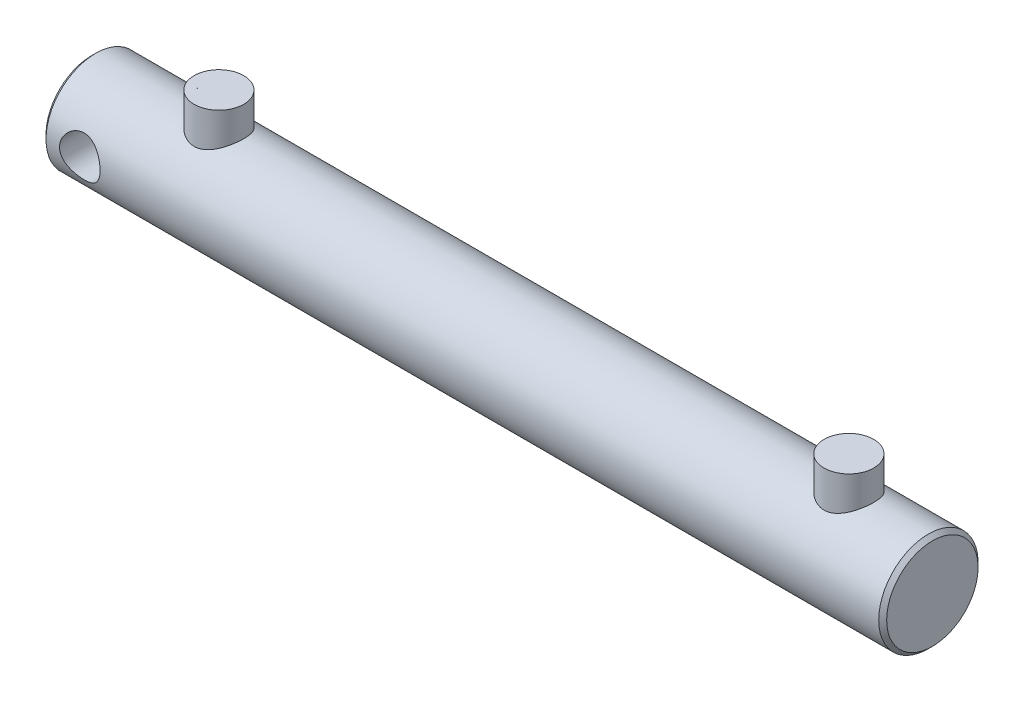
ISO-10303-21;
HEADER;
FILE_DESCRIPTION(('STEP AP214'),'2;1');
FILE_NAME('part.step','',(''),(''),'','','');
FILE_SCHEMA(('AUTOMOTIVE_DESIGN { 1 0 10303 214 1 1 1 1 }'));
ENDSEC;
DATA;
#1=APPLICATION_CONTEXT('core data for automotive mechanical design processes');
#2=APPLICATION_PROTOCOL_DEFINITION('international standard','automotive_design',2000,#1);
#3=PRODUCT_CONTEXT('',#1,'mechanical');
#4=PRODUCT('Part','Part','',(#3));
#5=PRODUCT_RELATED_PRODUCT_CATEGORY('part','',(#4));
#6=PRODUCT_DEFINITION_FORMATION('','',#4);
#7=PRODUCT_DEFINITION_CONTEXT('part definition',#1,'design');
#8=PRODUCT_DEFINITION('design','',#6,#7);
#9=PRODUCT_DEFINITION_SHAPE('','',#8);
#10=(LENGTH_UNIT() NAMED_UNIT(*) SI_UNIT(.MILLI.,.METRE.));
#11=(NAMED_UNIT(*) PLANE_ANGLE_UNIT() SI_UNIT($,.RADIAN.));
#12=(NAMED_UNIT(*) SI_UNIT($,.STERADIAN.) SOLID_ANGLE_UNIT());
#13=UNCERTAINTY_MEASURE_WITH_UNIT(LENGTH_MEASURE(1.E-05),#10,'distance_accuracy_value','');
#14=(GEOMETRIC_REPRESENTATION_CONTEXT(3) GLOBAL_UNCERTAINTY_ASSIGNED_CONTEXT((#13)) GLOBAL_UNIT_ASSIGNED_CONTEXT((#10,
#11,#12)) REPRESENTATION_CONTEXT('',''));
#15=CARTESIAN_POINT('',(0.,0.,0.));
#16=DIRECTION('',(0.,0.,1.));
#17=DIRECTION('',(1.,0.,0.));
#18=AXIS2_PLACEMENT_3D('',#15,#16,#17);
#19=CARTESIAN_POINT('',(-211.5,0.,0.));
#20=DIRECTION('',(-1.,0.,0.));
#21=DIRECTION('',(0.,0.,1.));
#22=AXIS2_PLACEMENT_3D('',#19,#20,#21);
#23=CYLINDRICAL_SURFACE('',#22,25.);
#24=CARTESIAN_POINT('',(-147.5,21.650635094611,-12.5));
#25=CARTESIAN_POINT('',(-147.825828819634,21.650636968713,-12.4999985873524));
#26=CARTESIAN_POINT('',(-148.151686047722,21.6580155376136,-12.4872432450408));
#27=CARTESIAN_POINT('',(-148.800889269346,21.6872558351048,-12.4363891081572));
#28=CARTESIAN_POINT('',(-149.12423402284,21.7091243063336,-12.3982785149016));
#29=CARTESIAN_POINT('',(-149.766364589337,21.7665787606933,-12.297130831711));
#30=CARTESIAN_POINT('',(-150.085140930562,21.802189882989,-12.2340480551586));
#31=CARTESIAN_POINT('',(-150.715226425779,21.8858435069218,-12.0837589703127));
#32=CARTESIAN_POINT('',(-151.026536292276,21.9338848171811,-11.9965549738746));
#33=CARTESIAN_POINT('',(-151.638091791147,22.0405000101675,-11.7995262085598));
#34=CARTESIAN_POINT('',(-151.938389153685,22.0990140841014,-11.6898294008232));
#35=CARTESIAN_POINT('',(-152.528172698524,22.2249725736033,-11.4485414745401));
#36=CARTESIAN_POINT('',(-152.817654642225,22.2924204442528,-11.3169418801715));
#37=CARTESIAN_POINT('',(-153.667464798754,22.5052717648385,-10.8909843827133));
#38=CARTESIAN_POINT('',(-154.2097361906,22.6612898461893,-10.5652792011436));
#39=CARTESIAN_POINT('',(-155.278979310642,22.9996468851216,-9.80822889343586));
#40=CARTESIAN_POINT('',(-155.801000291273,23.1830954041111,-9.37038644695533));
#41=CARTESIAN_POINT('',(-156.525932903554,23.4556474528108,-8.65437620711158));
#42=CARTESIAN_POINT('',(-156.758042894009,23.5461267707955,-8.40562738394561));
#43=CARTESIAN_POINT('',(-157.201667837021,23.7240607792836,-7.8894445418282));
#44=CARTESIAN_POINT('',(-157.413190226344,23.8115165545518,-7.62201733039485));
#45=CARTESIAN_POINT('',(-157.827960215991,23.9870610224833,-7.05096348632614));
#46=CARTESIAN_POINT('',(-158.029675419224,24.0747909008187,-6.74611185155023));
#47=CARTESIAN_POINT('',(-158.406506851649,24.2419754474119,-6.1181832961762));
#48=CARTESIAN_POINT('',(-158.581621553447,24.3214296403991,-5.79510533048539));
#49=CARTESIAN_POINT('',(-158.90343651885,24.4697359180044,-5.13293948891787));
#50=CARTESIAN_POINT('',(-159.050150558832,24.5385931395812,-4.79385947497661));
#51=CARTESIAN_POINT('',(-159.313578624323,24.6636816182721,-4.10199116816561));
#52=CARTESIAN_POINT('',(-159.430295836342,24.7199142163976,-3.74920433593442));
#53=CARTESIAN_POINT('',(-159.625035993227,24.8145076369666,-3.05827019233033));
#54=CARTESIAN_POINT('',(-159.705220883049,24.8538552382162,-2.72086672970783));
#55=CARTESIAN_POINT('',(-159.837413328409,24.9190379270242,-2.0392914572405));
#56=CARTESIAN_POINT('',(-159.889422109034,24.9448736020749,-1.69511994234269));
#57=CARTESIAN_POINT('',(-159.964549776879,24.9822725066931,-1.00304268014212));
#58=CARTESIAN_POINT('',(-159.987683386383,24.9938430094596,-0.655138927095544));
#59=CARTESIAN_POINT('',(-160.004785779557,25.0023919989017,0.041555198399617));
#60=CARTESIAN_POINT('',(-159.998756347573,24.9993713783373,0.390345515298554));
#61=CARTESIAN_POINT('',(-159.959420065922,24.9797298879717,1.05545670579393));
#62=CARTESIAN_POINT('',(-159.928534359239,24.9643162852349,1.37196006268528));
#63=CARTESIAN_POINT('',(-159.842896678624,24.9217919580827,2.00090286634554));
#64=CARTESIAN_POINT('',(-159.788146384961,24.8946820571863,2.31334259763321));
#65=CARTESIAN_POINT('',(-159.655375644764,24.8294144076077,2.93205832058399));
#66=CARTESIAN_POINT('',(-159.577354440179,24.7912562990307,3.23833411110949));
#67=CARTESIAN_POINT('',(-159.398835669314,24.7047808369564,3.84278923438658));
#68=CARTESIAN_POINT('',(-159.298337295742,24.6564631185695,4.14096827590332));
#69=CARTESIAN_POINT('',(-159.074267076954,24.5500266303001,4.7315389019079));
#70=CARTESIAN_POINT('',(-158.950396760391,24.4917821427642,5.02379438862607));
#71=CARTESIAN_POINT('',(-158.681577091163,24.367262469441,5.59664626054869));
#72=CARTESIAN_POINT('',(-158.536627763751,24.3009872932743,5.87724265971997));
#73=CARTESIAN_POINT('',(-158.226722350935,24.1618170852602,6.42546402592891));
#74=CARTESIAN_POINT('',(-158.061764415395,24.0889214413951,6.69308779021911));
#75=CARTESIAN_POINT('',(-157.712866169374,23.9380009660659,7.21427443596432));
#76=CARTESIAN_POINT('',(-157.528918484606,23.859974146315,7.46783179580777));
#77=CARTESIAN_POINT('',(-157.124909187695,23.6928666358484,7.98299107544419));
#78=CARTESIAN_POINT('',(-156.903077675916,23.6034377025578,8.24309375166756));
#79=CARTESIAN_POINT('',(-156.439270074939,23.4225308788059,8.74390948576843));
#80=CARTESIAN_POINT('',(-156.197292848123,23.331052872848,8.98462144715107));
#81=CARTESIAN_POINT('',(-155.694268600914,23.1482419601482,9.4456566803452));
#82=CARTESIAN_POINT('',(-155.433209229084,23.0569091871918,9.66596653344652));
#83=CARTESIAN_POINT('',(-154.893337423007,22.876771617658,10.0849060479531));
#84=CARTESIAN_POINT('',(-154.614521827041,22.7879672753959,10.2835318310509));
#85=CARTESIAN_POINT('',(-154.022086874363,22.6097947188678,10.6698301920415));
#86=CARTESIAN_POINT('',(-153.70738198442,22.520752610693,10.8559934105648));
#87=CARTESIAN_POINT('',(-153.061183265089,22.3512779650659,11.2007713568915));
#88=CARTESIAN_POINT('',(-152.729697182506,22.2708415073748,11.3593986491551));
#89=CARTESIAN_POINT('',(-152.051996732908,22.1215174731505,11.6475234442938));
#90=CARTESIAN_POINT('',(-151.705791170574,22.0526231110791,11.7770380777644));
#91=CARTESIAN_POINT('',(-151.000945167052,21.9291206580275,12.0054389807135));
#92=CARTESIAN_POINT('',(-150.642306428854,21.8745106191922,12.1043294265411));
#93=CARTESIAN_POINT('',(-149.944369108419,21.7856557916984,12.26347567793));
#94=CARTESIAN_POINT('',(-149.605788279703,21.7501406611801,12.3261709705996));
#95=CARTESIAN_POINT('',(-148.923342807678,21.6947067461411,12.4234802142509));
#96=CARTESIAN_POINT('',(-148.579478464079,21.6747870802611,12.4580957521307));
#97=CARTESIAN_POINT('',(-147.889711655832,21.6514003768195,12.4986965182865));
#98=CARTESIAN_POINT('',(-147.543810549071,21.6479233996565,12.5046990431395));
#99=CARTESIAN_POINT('',(-146.852946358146,21.6575485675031,12.4880218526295));
#100=CARTESIAN_POINT('',(-146.50798321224,21.6706495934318,12.4653440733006));
#101=CARTESIAN_POINT('',(-145.859787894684,21.71053573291,12.3957257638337));
#102=CARTESIAN_POINT('',(-145.556131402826,21.7356609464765,12.3517217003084));
#103=CARTESIAN_POINT('',(-144.953946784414,21.7977675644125,12.2417856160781));
#104=CARTESIAN_POINT('',(-144.655420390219,21.8347528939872,12.1758463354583));
#105=CARTESIAN_POINT('',(-144.065469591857,21.9194151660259,12.0227647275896));
#106=CARTESIAN_POINT('',(-143.774044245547,21.967090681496,11.9356252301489));
#107=CARTESIAN_POINT('',(-143.199706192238,22.0717635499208,11.7409310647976));
#108=CARTESIAN_POINT('',(-142.916796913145,22.12876459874,11.6333683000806));
#109=CARTESIAN_POINT('',(-142.348184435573,22.2533312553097,11.3933466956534));
#110=CARTESIAN_POINT('',(-142.062947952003,22.3212614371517,11.2599724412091));
#111=CARTESIAN_POINT('',(-141.504535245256,22.4638079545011,10.9728312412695));
#112=CARTESIAN_POINT('',(-141.231364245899,22.5384271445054,10.8190555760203));
#113=CARTESIAN_POINT('',(-140.698252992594,22.6924793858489,10.4920939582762));
#114=CARTESIAN_POINT('',(-140.438315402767,22.7719133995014,10.3189041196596));
#115=CARTESIAN_POINT('',(-139.932706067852,22.933742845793,9.95405785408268));
#116=CARTESIAN_POINT('',(-139.687035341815,23.0161384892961,9.76240011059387));
#117=CARTESIAN_POINT('',(-139.180799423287,23.1925831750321,9.33615452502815));
#118=CARTESIAN_POINT('',(-138.922274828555,23.2867891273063,9.09920221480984));
#119=CARTESIAN_POINT('',(-138.425930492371,23.4741545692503,8.60430434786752));
#120=CARTESIAN_POINT('',(-138.1881046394,23.5673143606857,8.34636503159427));
#121=CARTESIAN_POINT('',(-137.734261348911,23.7502946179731,7.81048740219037));
#122=CARTESIAN_POINT('',(-137.518260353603,23.8401125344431,7.53253427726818));
#123=CARTESIAN_POINT('',(-137.109811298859,24.0139935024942,6.95830888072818));
#124=CARTESIAN_POINT('',(-136.917353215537,24.0980589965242,6.66204448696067));
#125=CARTESIAN_POINT('',(-136.552580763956,24.2604327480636,6.04450287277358));
#126=CARTESIAN_POINT('',(-136.380942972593,24.3385268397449,5.72276854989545));
#127=CARTESIAN_POINT('',(-136.065661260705,24.4841693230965,5.0635347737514));
#128=CARTESIAN_POINT('',(-135.922018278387,24.5517173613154,4.72603479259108));
#129=CARTESIAN_POINT('',(-135.664459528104,24.6742211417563,4.03792427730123));
#130=CARTESIAN_POINT('',(-135.55052252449,24.7291858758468,3.6873233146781));
#131=CARTESIAN_POINT('',(-135.353726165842,24.8248778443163,2.97561663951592));
#132=CARTESIAN_POINT('',(-135.270863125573,24.8656067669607,2.61451217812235));
#133=CARTESIAN_POINT('',(-135.143513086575,24.9284979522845,1.91850625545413));
#134=CARTESIAN_POINT('',(-135.096201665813,24.9520213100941,1.58424214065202));
#135=CARTESIAN_POINT('',(-135.028766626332,24.9856118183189,0.912314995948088));
#136=CARTESIAN_POINT('',(-135.00864128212,24.9956798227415,0.574652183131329));
#137=CARTESIAN_POINT('',(-134.995841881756,25.0020787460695,-0.101219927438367));
#138=CARTESIAN_POINT('',(-135.003159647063,24.9984137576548,-0.439429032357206));
#139=CARTESIAN_POINT('',(-135.045132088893,24.9774578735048,-1.11371445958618));
#140=CARTESIAN_POINT('',(-135.079786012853,24.9601673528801,-1.44979084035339));
#141=CARTESIAN_POINT('',(-135.172800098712,24.9140191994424,-2.09506424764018));
#142=CARTESIAN_POINT('',(-135.229444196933,24.8860005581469,-2.40457105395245));
#143=CARTESIAN_POINT('',(-135.365571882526,24.8191625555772,-3.01730683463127));
#144=CARTESIAN_POINT('',(-135.445054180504,24.7803438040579,-3.320536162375));
#145=CARTESIAN_POINT('',(-135.626075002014,24.6927888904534,-3.91887965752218));
#146=CARTESIAN_POINT('',(-135.727615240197,24.644051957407,-4.21399319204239));
#147=CARTESIAN_POINT('',(-135.951830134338,24.5377360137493,-4.79443241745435));
#148=CARTESIAN_POINT('',(-136.074505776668,24.4801565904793,-5.0797576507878));
#149=CARTESIAN_POINT('',(-136.345646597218,24.3547642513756,-5.65106966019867));
#150=CARTESIAN_POINT('',(-136.494986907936,24.2866201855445,-5.93656816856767));
#151=CARTESIAN_POINT('',(-136.814454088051,24.1435393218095,-6.49402514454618));
#152=CARTESIAN_POINT('',(-136.984588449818,24.0686000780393,-6.76597868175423));
#153=CARTESIAN_POINT('',(-137.344503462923,23.9135470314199,-7.29508667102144));
#154=CARTESIAN_POINT('',(-137.534288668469,23.8334320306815,-7.55223767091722));
#155=CARTESIAN_POINT('',(-137.93236125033,23.6697443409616,-8.05059010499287));
#156=CARTESIAN_POINT('',(-138.140648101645,23.5861717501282,-8.2917919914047));
#157=CARTESIAN_POINT('',(-138.596332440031,23.4089075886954,-8.7804991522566));
#158=CARTESIAN_POINT('',(-138.845558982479,23.3150375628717,-9.02623729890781));
#159=CARTESIAN_POINT('',(-139.363805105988,23.127673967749,-9.49603431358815));
#160=CARTESIAN_POINT('',(-139.632825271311,23.0341804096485,-9.72009254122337));
#161=CARTESIAN_POINT('',(-140.189584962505,22.8500132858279,-10.1454748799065));
#162=CARTESIAN_POINT('',(-140.477340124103,22.7593421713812,-10.3467796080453));
#163=CARTESIAN_POINT('',(-141.07002865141,22.5834994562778,-10.7251617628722));
#164=CARTESIAN_POINT('',(-141.374964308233,22.4983285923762,-10.9022359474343));
#165=CARTESIAN_POINT('',(-142.010467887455,22.3335584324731,-11.2360101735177));
#166=CARTESIAN_POINT('',(-142.341543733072,22.2542245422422,-11.3918772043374));
#167=CARTESIAN_POINT('',(-143.018159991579,22.1071923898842,-11.6746502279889));
#168=CARTESIAN_POINT('',(-143.363692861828,22.0394881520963,-11.801571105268));
#169=CARTESIAN_POINT('',(-144.066013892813,21.9185525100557,-12.0246888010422));
#170=CARTESIAN_POINT('',(-144.422770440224,21.8652839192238,-12.1209646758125));
#171=CARTESIAN_POINT('',(-145.145231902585,21.7753691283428,-12.2817688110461));
#172=CARTESIAN_POINT('',(-145.510930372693,21.738711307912,-12.346319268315));
#173=CARTESIAN_POINT('',(-146.147494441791,21.6911886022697,-12.4295575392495));
#174=CARTESIAN_POINT('',(-146.417060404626,21.6760179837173,-12.4559482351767));
#175=CARTESIAN_POINT('',(-146.957744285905,21.6557401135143,-12.4911706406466));
#176=CARTESIAN_POINT('',(-147.228862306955,21.6506335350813,-12.5000011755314));
#177=CARTESIAN_POINT('',(-147.5,21.650635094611,-12.5));
#178=B_SPLINE_CURVE_WITH_KNOTS('',3,(#24,#25,#26,#27,#28,#29,#30,#31,#32,#33,#34,#35,#36,#37,
#38,#39,#40,#41,#42,#43,#44,#45,#46,#47,#48,#49,#50,#51,#52,#53,#54,#55,#56,#57,#58,#59,#60,#61,
#62,#63,#64,#65,#66,#67,#68,#69,#70,#71,#72,#73,#74,#75,#76,#77,#78,#79,#80,#81,#82,#83,#84,#85,
#86,#87,#88,#89,#90,#91,#92,#93,#94,#95,#96,#97,#98,#99,#100,#101,#102,#103,#104,#105,#106,#107,
#108,#109,#110,#111,#112,#113,#114,#115,#116,#117,#118,#119,#120,#121,#122,#123,#124,#125,#126,
#127,#128,#129,#130,#131,#132,#133,#134,#135,#136,#137,#138,#139,#140,#141,#142,#143,#144,#145,
#146,#147,#148,#149,#150,#151,#152,#153,#154,#155,#156,#157,#158,#159,#160,#161,#162,#163,#164,
#165,#166,#167,#168,#169,#170,#171,#172,#173,#174,#175,#176,#177),.UNSPECIFIED.,.T.,.F.,(4,2,2,
2,2,2,2,2,2,2,2,2,2,2,2,2,2,2,2,2,2,2,2,2,2,2,2,2,2,2,2,2,2,2,2,2,2,2,2,2,2,2,2,2,2,2,2,2,2,2,2,
2,2,2,2,2,2,2,2,2,2,2,2,2,2,2,2,2,2,2,2,2,2,2,2,2,4),(0.,0.977205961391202,1.9548669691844,
2.93432493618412,3.91368906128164,4.88762893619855,5.86194658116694,7.80874820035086,
9.91611803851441,10.9713526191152,12.0262045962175,13.1525478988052,14.2789558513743,
15.4048160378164,16.5305565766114,17.576215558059,18.6218290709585,19.6669092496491,
20.7119254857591,21.6659378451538,22.6198830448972,23.5738593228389,24.5278698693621,
25.4950080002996,26.4621449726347,27.4293714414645,28.3969749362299,29.4558985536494,
30.5148820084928,31.5745570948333,32.6344214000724,33.7619649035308,34.8889925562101,
36.0153552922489,37.14156435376,38.17858119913,39.2155394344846,40.2518707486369,
41.2881321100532,42.2106469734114,43.1334674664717,44.0561648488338,44.9792288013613,
45.9446183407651,46.9104218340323,47.8764189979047,48.8424850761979,49.9306247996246,
51.0184421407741,52.1070729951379,53.1952387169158,54.3125134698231,55.429825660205,
56.5463369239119,57.6627157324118,58.6766202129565,59.6904603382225,60.7039983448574,
61.7175084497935,62.6641089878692,63.6106560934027,64.5572768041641,65.5039417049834,
66.4908805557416,67.4781760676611,68.4657009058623,69.4531977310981,70.5391008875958,
71.6250361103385,72.71188954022,73.7988882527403,74.9206611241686,76.0418558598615,
77.1601343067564,78.2776292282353,79.0907545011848,79.9039341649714),.UNSPECIFIED.);
#179=CARTESIAN_POINT('',(-147.5,21.650635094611,-12.5));
#180=VERTEX_POINT('',#179);
#181=EDGE_CURVE('E39',#180,#180,#178,.T.);
#182=ORIENTED_EDGE('',*,*,#181,.F.);
#183=EDGE_LOOP('',(#182));
#184=FACE_BOUND('',#183,.T.);
#185=CARTESIAN_POINT('',(-182.3,0.,-25.));
#186=CARTESIAN_POINT('',(-182.300001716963,0.273789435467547,-24.9999986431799));
#187=CARTESIAN_POINT('',(-182.311038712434,0.547678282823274,-24.9954899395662));
#188=CARTESIAN_POINT('',(-182.355085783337,1.09351246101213,-24.9775677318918));
#189=CARTESIAN_POINT('',(-182.388110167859,1.36545640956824,-24.9641484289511));
#190=CARTESIAN_POINT('',(-182.475895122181,1.90589153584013,-24.9287196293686));
#191=CARTESIAN_POINT('',(-182.530705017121,2.17437344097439,-24.9066906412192));
#192=CARTESIAN_POINT('',(-182.661508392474,2.70533868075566,-24.8546237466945));
#193=CARTESIAN_POINT('',(-182.737503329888,2.96782160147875,-24.8245852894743));
#194=CARTESIAN_POINT('',(-182.909657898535,3.48412634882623,-24.7573909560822));
#195=CARTESIAN_POINT('',(-183.005747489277,3.73797478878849,-24.7202598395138));
#196=CARTESIAN_POINT('',(-183.217413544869,4.23637900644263,-24.6397409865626));
#197=CARTESIAN_POINT('',(-183.332990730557,4.48093443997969,-24.5963530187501));
#198=CARTESIAN_POINT('',(-183.582658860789,4.95920699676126,-24.5043977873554));
#199=CARTESIAN_POINT('',(-183.71673892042,5.19293038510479,-24.4558335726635));
#200=CARTESIAN_POINT('',(-184.002515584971,5.64846413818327,-24.3546587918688));
#201=CARTESIAN_POINT('',(-184.154218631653,5.87027010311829,-24.3020467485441));
#202=CARTESIAN_POINT('',(-184.648401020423,6.53495483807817,-24.1352121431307));
#203=CARTESIAN_POINT('',(-185.019052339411,6.95614665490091,-24.016166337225));
#204=CARTESIAN_POINT('',(-185.824387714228,7.73234580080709,-23.7776427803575));
#205=CARTESIAN_POINT('',(-186.259104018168,8.08731959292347,-23.6581648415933));
#206=CARTESIAN_POINT('',(-186.962487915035,8.57101087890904,-23.4855059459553));
#207=CARTESIAN_POINT('',(-187.211689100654,8.72699363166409,-23.4278402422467));
#208=CARTESIAN_POINT('',(-187.723454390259,9.01726356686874,-23.3176551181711));
#209=CARTESIAN_POINT('',(-187.986012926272,9.15155969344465,-23.2651335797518));
#210=CARTESIAN_POINT('',(-188.522800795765,9.39728813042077,-23.1669700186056));
#211=CARTESIAN_POINT('',(-188.797028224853,9.50872415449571,-23.1213268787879));
#212=CARTESIAN_POINT('',(-189.355281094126,9.70765251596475,-23.0385135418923));
#213=CARTESIAN_POINT('',(-189.63930583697,9.79514655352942,-23.0013427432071));
#214=CARTESIAN_POINT('',(-190.20152230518,9.94170066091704,-22.9383663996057));
#215=CARTESIAN_POINT('',(-190.479367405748,10.0018973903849,-22.9121113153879));
#216=CARTESIAN_POINT('',(-191.039859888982,10.0989538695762,-22.8694982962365));
#217=CARTESIAN_POINT('',(-191.322507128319,10.1358143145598,-22.8531400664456));
#218=CARTESIAN_POINT('',(-191.890181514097,10.1857387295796,-22.830932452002));
#219=CARTESIAN_POINT('',(-192.17520754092,10.1988133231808,-22.8250783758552));
#220=CARTESIAN_POINT('',(-192.745364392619,10.2010320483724,-22.8240871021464));
#221=CARTESIAN_POINT('',(-193.030495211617,10.1901773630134,-22.8289493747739));
#222=CARTESIAN_POINT('',(-193.577650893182,10.1463488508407,-22.8484597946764));
#223=CARTESIAN_POINT('',(-193.839838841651,10.1150529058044,-22.8623652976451));
#224=CARTESIAN_POINT('',(-194.360508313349,10.0323483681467,-22.8987778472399));
#225=CARTESIAN_POINT('',(-194.618988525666,9.98093283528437,-22.9212878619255));
#226=CARTESIAN_POINT('',(-195.130362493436,9.85851435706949,-22.9742057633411));
#227=CARTESIAN_POINT('',(-195.383257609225,9.78751623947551,-23.0046117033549));
#228=CARTESIAN_POINT('',(-195.882066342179,9.62654350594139,-23.0724355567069));
#229=CARTESIAN_POINT('',(-196.127977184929,9.53656146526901,-23.1098562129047));
#230=CARTESIAN_POINT('',(-196.616250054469,9.33635492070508,-23.1914724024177));
#231=CARTESIAN_POINT('',(-196.858437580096,9.22575520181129,-23.2357904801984));
#232=CARTESIAN_POINT('',(-197.332771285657,8.98637481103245,-23.3294145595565));
#233=CARTESIAN_POINT('',(-197.564913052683,8.85758625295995,-23.3787227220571));
#234=CARTESIAN_POINT('',(-198.017893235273,8.58271796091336,-23.4810232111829));
#235=CARTESIAN_POINT('',(-198.238730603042,8.43663662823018,-23.5340158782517));
#236=CARTESIAN_POINT('',(-198.668018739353,8.12806439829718,-23.6423625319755));
#237=CARTESIAN_POINT('',(-198.876468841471,7.96557261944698,-23.6977166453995));
#238=CARTESIAN_POINT('',(-199.296327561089,7.61126566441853,-23.8139905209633));
#239=CARTESIAN_POINT('',(-199.506609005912,7.41814148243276,-23.8749980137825));
#240=CARTESIAN_POINT('',(-199.910247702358,7.01495391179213,-23.9965567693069));
#241=CARTESIAN_POINT('',(-200.103610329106,6.80489594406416,-24.0571081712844));
#242=CARTESIAN_POINT('',(-200.472422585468,6.36883544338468,-24.1762081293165));
#243=CARTESIAN_POINT('',(-200.647861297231,6.14282333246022,-24.2347554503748));
#244=CARTESIAN_POINT('',(-200.979444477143,5.67634341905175,-24.3482384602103));
#245=CARTESIAN_POINT('',(-201.135596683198,5.43588147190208,-24.4031755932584));
#246=CARTESIAN_POINT('',(-201.430678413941,4.93648649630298,-24.5091338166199));
#247=CARTESIAN_POINT('',(-201.569162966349,4.67726664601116,-24.5600446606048));
#248=CARTESIAN_POINT('',(-201.823651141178,4.14681343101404,-24.6551522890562));
#249=CARTESIAN_POINT('',(-201.939654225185,3.87557977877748,-24.6993489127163));
#250=CARTESIAN_POINT('',(-202.147996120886,3.32314262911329,-24.7797213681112));
#251=CARTESIAN_POINT('',(-202.240345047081,3.0419434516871,-24.8159006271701));
#252=CARTESIAN_POINT('',(-202.400441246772,2.47163195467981,-24.8791744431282));
#253=CARTESIAN_POINT('',(-202.468190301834,2.18252020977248,-24.9062696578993));
#254=CARTESIAN_POINT('',(-202.574934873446,1.61661942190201,-24.9491899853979));
#255=CARTESIAN_POINT('',(-202.615435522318,1.34015814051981,-24.9656030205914));
#256=CARTESIAN_POINT('',(-202.673625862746,0.784456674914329,-24.9892367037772));
#257=CARTESIAN_POINT('',(-202.691316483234,0.505216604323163,-24.9964577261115));
#258=CARTESIAN_POINT('',(-202.703688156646,-0.053790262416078,-25.0015043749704));
#259=CARTESIAN_POINT('',(-202.698374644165,-0.333556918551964,-24.9993322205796));
#260=CARTESIAN_POINT('',(-202.66481007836,-0.891476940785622,-24.9856584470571));
#261=CARTESIAN_POINT('',(-202.636559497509,-1.16963033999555,-24.9741570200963));
#262=CARTESIAN_POINT('',(-202.559307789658,-1.70910499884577,-24.9429047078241));
#263=CARTESIAN_POINT('',(-202.511349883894,-1.97060070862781,-24.9235691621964));
#264=CARTESIAN_POINT('',(-202.395366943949,-2.48839302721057,-24.8772076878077));
#265=CARTESIAN_POINT('',(-202.327342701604,-2.74468984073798,-24.8501820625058));
#266=CARTESIAN_POINT('',(-202.171853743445,-3.25041966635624,-24.7891034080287));
#267=CARTESIAN_POINT('',(-202.084390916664,-3.49985334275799,-24.7550510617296));
#268=CARTESIAN_POINT('',(-201.890723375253,-3.99047626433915,-24.6807149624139));
#269=CARTESIAN_POINT('',(-201.784511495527,-4.23166231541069,-24.6404288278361));
#270=CARTESIAN_POINT('',(-201.550676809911,-4.71154370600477,-24.5532610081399));
#271=CARTESIAN_POINT('',(-201.422500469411,-4.94993951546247,-24.5062158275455));
#272=CARTESIAN_POINT('',(-201.148039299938,-5.41520072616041,-24.4076254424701));
#273=CARTESIAN_POINT('',(-201.001747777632,-5.64206182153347,-24.3560785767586));
#274=CARTESIAN_POINT('',(-200.692041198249,-6.08301428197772,-24.2497090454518));
#275=CARTESIAN_POINT('',(-200.528623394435,-6.29710359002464,-24.1948858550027));
#276=CARTESIAN_POINT('',(-200.185662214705,-6.7114023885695,-24.083253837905));
#277=CARTESIAN_POINT('',(-200.0061180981,-6.91161124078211,-24.0264449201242));
#278=CARTESIAN_POINT('',(-199.618984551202,-7.31043905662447,-23.9082343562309));
#279=CARTESIAN_POINT('',(-199.410315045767,-7.50799727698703,-23.8467860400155));
#280=CARTESIAN_POINT('',(-198.97699477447,-7.88485612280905,-23.7248448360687));
#281=CARTESIAN_POINT('',(-198.752350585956,-8.06416418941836,-23.6643515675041));
#282=CARTESIAN_POINT('',(-198.288119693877,-8.40359447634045,-23.5459537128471));
#283=CARTESIAN_POINT('',(-198.048523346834,-8.5637041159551,-23.4880508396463));
#284=CARTESIAN_POINT('',(-197.555996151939,-8.86340597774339,-23.3766035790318));
#285=CARTESIAN_POINT('',(-197.303071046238,-9.00300693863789,-23.3230573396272));
#286=CARTESIAN_POINT('',(-196.782108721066,-9.26224753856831,-23.2213352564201));
#287=CARTESIAN_POINT('',(-196.51392354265,-9.38161962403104,-23.1732338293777));
#288=CARTESIAN_POINT('',(-195.967252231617,-9.59710554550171,-23.0848248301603));
#289=CARTESIAN_POINT('',(-195.688770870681,-9.69323000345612,-23.0445137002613));
#290=CARTESIAN_POINT('',(-195.12354634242,-9.86123160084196,-22.9731245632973));
#291=CARTESIAN_POINT('',(-194.836806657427,-9.93311880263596,-22.9420427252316));
#292=CARTESIAN_POINT('',(-194.25726859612,-10.0518392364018,-22.890276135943));
#293=CARTESIAN_POINT('',(-193.964470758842,-10.098674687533,-22.8695904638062));
#294=CARTESIAN_POINT('',(-193.397283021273,-10.1641633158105,-22.840555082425));
#295=CARTESIAN_POINT('',(-193.123145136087,-10.1846546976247,-22.8314017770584));
#296=CARTESIAN_POINT('',(-192.573963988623,-10.2034310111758,-22.8230170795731));
#297=CARTESIAN_POINT('',(-192.298920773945,-10.2017170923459,-22.823785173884));
#298=CARTESIAN_POINT('',(-191.750116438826,-10.176105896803,-22.8352153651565));
#299=CARTESIAN_POINT('',(-191.476355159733,-10.1522114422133,-22.8458762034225));
#300=CARTESIAN_POINT('',(-190.932183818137,-10.0825193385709,-22.8767185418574));
#301=CARTESIAN_POINT('',(-190.661773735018,-10.0367218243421,-22.8968999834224));
#302=CARTESIAN_POINT('',(-190.137843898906,-9.92616689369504,-22.945035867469));
#303=CARTESIAN_POINT('',(-189.884098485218,-9.86231170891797,-22.9726178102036));
#304=CARTESIAN_POINT('',(-189.382997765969,-9.71557925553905,-23.03505747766));
#305=CARTESIAN_POINT('',(-189.135644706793,-9.63269539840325,-23.0699177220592));
#306=CARTESIAN_POINT('',(-188.648856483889,-9.44861946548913,-23.1459174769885));
#307=CARTESIAN_POINT('',(-188.409421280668,-9.3474274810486,-23.1870569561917));
#308=CARTESIAN_POINT('',(-187.939722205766,-9.12749285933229,-23.2745112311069));
#309=CARTESIAN_POINT('',(-187.709459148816,-9.00874866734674,-23.3208264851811));
#310=CARTESIAN_POINT('',(-187.246047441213,-8.74704987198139,-23.4202869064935));
#311=CARTESIAN_POINT('',(-187.013521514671,-8.60308382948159,-23.4736733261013));
#312=CARTESIAN_POINT('',(-186.561253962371,-8.29733760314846,-23.5834808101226));
#313=CARTESIAN_POINT('',(-186.341512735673,-8.13555686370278,-23.6399019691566));
#314=CARTESIAN_POINT('',(-185.91587364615,-7.79509906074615,-23.7543403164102));
#315=CARTESIAN_POINT('',(-185.709979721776,-7.61641722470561,-23.8123579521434));
#316=CARTESIAN_POINT('',(-185.313168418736,-7.24317940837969,-23.9285300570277));
#317=CARTESIAN_POINT('',(-185.122251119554,-7.04862334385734,-23.9866845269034));
#318=CARTESIAN_POINT('',(-184.743809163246,-6.63071217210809,-24.1056847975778));
#319=CARTESIAN_POINT('',(-184.55742501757,-6.40629638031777,-24.1664398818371));
#320=CARTESIAN_POINT('',(-184.204265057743,-5.94187315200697,-24.2848006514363));
#321=CARTESIAN_POINT('',(-184.037482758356,-5.70187091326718,-24.342407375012));
#322=CARTESIAN_POINT('',(-183.724582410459,-5.20746466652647,-24.4529448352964));
#323=CARTESIAN_POINT('',(-183.578479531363,-4.95305027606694,-24.5058721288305));
#324=CARTESIAN_POINT('',(-183.308321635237,-4.43161956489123,-24.6055111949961));
#325=CARTESIAN_POINT('',(-183.184264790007,-4.16460429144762,-24.6522234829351));
#326=CARTESIAN_POINT('',(-182.961330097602,-3.62458274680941,-24.7373360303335));
#327=CARTESIAN_POINT('',(-182.862047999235,-3.35176427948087,-24.7758679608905));
#328=CARTESIAN_POINT('',(-182.686882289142,-2.7976980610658,-24.8445322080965));
#329=CARTESIAN_POINT('',(-182.610996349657,-2.51645115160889,-24.8746653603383));
#330=CARTESIAN_POINT('',(-182.483615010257,-1.94846806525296,-24.925580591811));
#331=CARTESIAN_POINT('',(-182.432054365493,-1.66174874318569,-24.9463876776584));
#332=CARTESIAN_POINT('',(-182.353648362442,-1.08455530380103,-24.9781334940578));
#333=CARTESIAN_POINT('',(-182.326784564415,-0.794084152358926,-24.9890795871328));
#334=CARTESIAN_POINT('',(-182.308274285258,-0.419253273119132,-24.9966251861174));
#335=CARTESIAN_POINT('',(-182.305172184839,-0.335440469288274,-24.9978901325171));
#336=CARTESIAN_POINT('',(-182.301034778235,-0.167754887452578,-24.9995777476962));
#337=CARTESIAN_POINT('',(-182.299999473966,-0.0838821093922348,-25.0000004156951));
#338=CARTESIAN_POINT('',(-182.3,0.,-25.));
#339=B_SPLINE_CURVE_WITH_KNOTS('',3,(#185,#186,#187,#188,#189,#190,#191,#192,#193,#194,#195,
#196,#197,#198,#199,#200,#201,#202,#203,#204,#205,#206,#207,#208,#209,#210,#211,#212,#213,#214,
#215,#216,#217,#218,#219,#220,#221,#222,#223,#224,#225,#226,#227,#228,#229,#230,#231,#232,#233,
#234,#235,#236,#237,#238,#239,#240,#241,#242,#243,#244,#245,#246,#247,#248,#249,#250,#251,#252,
#253,#254,#255,#256,#257,#258,#259,#260,#261,#262,#263,#264,#265,#266,#267,#268,#269,#270,#271,
#272,#273,#274,#275,#276,#277,#278,#279,#280,#281,#282,#283,#284,#285,#286,#287,#288,#289,#290,
#291,#292,#293,#294,#295,#296,#297,#298,#299,#300,#301,#302,#303,#304,#305,#306,#307,#308,#309,
#310,#311,#312,#313,#314,#315,#316,#317,#318,#319,#320,#321,#322,#323,#324,#325,#326,#327,#328,
#329,#330,#331,#332,#333,#334,#335,#336,#337,#338),.UNSPECIFIED.,.T.,.F.,(4,2,2,2,2,2,2,2,2,2,2,
2,2,2,2,2,2,2,2,2,2,2,2,2,2,2,2,2,2,2,2,2,2,2,2,2,2,2,2,2,2,2,2,2,2,2,2,2,2,2,2,2,2,2,2,2,2,2,2,
2,2,2,2,2,2,2,2,2,2,2,2,2,2,2,2,2,4),(0.,0.821282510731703,1.6431000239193,2.46678893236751,
3.29053450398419,4.11145536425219,4.93240659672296,5.75287692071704,6.57364810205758,
8.28632730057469,9.99987156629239,10.897704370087,11.7951659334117,12.6924815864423,
13.5897335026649,14.4451011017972,15.3004432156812,16.1554032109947,17.010320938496,
17.8026371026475,18.5952268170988,19.3876213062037,20.1803262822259,20.9891888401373,
21.7984031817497,22.6076923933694,23.4170251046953,24.2918919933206,25.1664799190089,
26.0415974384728,26.9163627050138,27.8100268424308,28.7037123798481,29.5970151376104,
30.490253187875,31.3288614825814,32.1674356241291,33.0058116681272,33.8441704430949,
34.6429279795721,35.4416540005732,36.2403024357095,37.039256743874,37.8625419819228,
38.686132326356,39.5098549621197,40.3336154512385,41.2141546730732,42.0943334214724,
42.9750858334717,43.8554618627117,44.746700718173,45.6375315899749,46.5279921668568,
47.418373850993,48.2424819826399,49.0665474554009,49.8905080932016,50.71446365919,
51.5029072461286,52.2916242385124,53.0803372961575,53.8691202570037,54.7041620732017,
55.5392299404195,56.374534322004,57.2098431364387,58.1027169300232,58.9952944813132,
59.8885234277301,60.7816782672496,61.6591338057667,62.5365020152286,63.4115033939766,
64.2858509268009,64.5374707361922,64.7890907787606),.UNSPECIFIED.);
#340=CARTESIAN_POINT('',(-182.3,0.,-25.));
#341=VERTEX_POINT('',#340);
#342=EDGE_CURVE('E43',#341,#341,#339,.T.);
#343=ORIENTED_EDGE('',*,*,#342,.T.);
#344=EDGE_LOOP('',(#343));
#345=FACE_BOUND('',#344,.T.);
#346=CARTESIAN_POINT('',(-182.3,0.,25.));
#347=CARTESIAN_POINT('',(-182.300001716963,-0.273789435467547,24.9999986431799));
#348=CARTESIAN_POINT('',(-182.311038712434,-0.547678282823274,24.9954899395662));
#349=CARTESIAN_POINT('',(-182.355085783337,-1.09351246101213,24.9775677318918));
#350=CARTESIAN_POINT('',(-182.388110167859,-1.36545640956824,24.9641484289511));
#351=CARTESIAN_POINT('',(-182.475895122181,-1.90589153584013,24.9287196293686));
#352=CARTESIAN_POINT('',(-182.530705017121,-2.17437344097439,24.9066906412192));
#353=CARTESIAN_POINT('',(-182.661508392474,-2.70533868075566,24.8546237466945));
#354=CARTESIAN_POINT('',(-182.737503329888,-2.96782160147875,24.8245852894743));
#355=CARTESIAN_POINT('',(-182.909657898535,-3.48412634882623,24.7573909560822));
#356=CARTESIAN_POINT('',(-183.005747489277,-3.73797478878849,24.7202598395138));
#357=CARTESIAN_POINT('',(-183.217413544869,-4.23637900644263,24.6397409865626));
#358=CARTESIAN_POINT('',(-183.332990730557,-4.48093443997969,24.5963530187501));
#359=CARTESIAN_POINT('',(-183.582658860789,-4.95920699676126,24.5043977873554));
#360=CARTESIAN_POINT('',(-183.71673892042,-5.19293038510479,24.4558335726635));
#361=CARTESIAN_POINT('',(-184.002515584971,-5.64846413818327,24.3546587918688));
#362=CARTESIAN_POINT('',(-184.154218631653,-5.87027010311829,24.3020467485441));
#363=CARTESIAN_POINT('',(-184.648401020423,-6.53495483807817,24.1352121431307));
#364=CARTESIAN_POINT('',(-185.019052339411,-6.95614665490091,24.016166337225));
#365=CARTESIAN_POINT('',(-185.824387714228,-7.73234580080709,23.7776427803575));
#366=CARTESIAN_POINT('',(-186.259104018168,-8.08731959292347,23.6581648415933));
#367=CARTESIAN_POINT('',(-186.962487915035,-8.57101087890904,23.4855059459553));
#368=CARTESIAN_POINT('',(-187.211689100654,-8.72699363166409,23.4278402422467));
#369=CARTESIAN_POINT('',(-187.723454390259,-9.01726356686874,23.3176551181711));
#370=CARTESIAN_POINT('',(-187.986012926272,-9.15155969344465,23.2651335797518));
#371=CARTESIAN_POINT('',(-188.522800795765,-9.39728813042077,23.1669700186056));
#372=CARTESIAN_POINT('',(-188.797028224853,-9.50872415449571,23.1213268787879));
#373=CARTESIAN_POINT('',(-189.355281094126,-9.70765251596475,23.0385135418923));
#374=CARTESIAN_POINT('',(-189.63930583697,-9.79514655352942,23.0013427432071));
#375=CARTESIAN_POINT('',(-190.20152230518,-9.94170066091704,22.9383663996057));
#376=CARTESIAN_POINT('',(-190.479367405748,-10.0018973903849,22.9121113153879));
#377=CARTESIAN_POINT('',(-191.039859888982,-10.0989538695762,22.8694982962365));
#378=CARTESIAN_POINT('',(-191.322507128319,-10.1358143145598,22.8531400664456));
#379=CARTESIAN_POINT('',(-191.890181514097,-10.1857387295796,22.830932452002));
#380=CARTESIAN_POINT('',(-192.17520754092,-10.1988133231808,22.8250783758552));
#381=CARTESIAN_POINT('',(-192.745364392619,-10.2010320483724,22.8240871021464));
#382=CARTESIAN_POINT('',(-193.030495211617,-10.1901773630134,22.8289493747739));
#383=CARTESIAN_POINT('',(-193.577650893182,-10.1463488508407,22.8484597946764));
#384=CARTESIAN_POINT('',(-193.839838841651,-10.1150529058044,22.8623652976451));
#385=CARTESIAN_POINT('',(-194.360508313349,-10.0323483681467,22.8987778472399));
#386=CARTESIAN_POINT('',(-194.618988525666,-9.98093283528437,22.9212878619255));
#387=CARTESIAN_POINT('',(-195.130362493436,-9.85851435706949,22.9742057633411));
#388=CARTESIAN_POINT('',(-195.383257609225,-9.78751623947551,23.0046117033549));
#389=CARTESIAN_POINT('',(-195.882066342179,-9.62654350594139,23.0724355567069));
#390=CARTESIAN_POINT('',(-196.127977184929,-9.53656146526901,23.1098562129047));
#391=CARTESIAN_POINT('',(-196.616250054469,-9.33635492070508,23.1914724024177));
#392=CARTESIAN_POINT('',(-196.858437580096,-9.22575520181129,23.2357904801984));
#393=CARTESIAN_POINT('',(-197.332771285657,-8.98637481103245,23.3294145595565));
#394=CARTESIAN_POINT('',(-197.564913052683,-8.85758625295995,23.3787227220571));
#395=CARTESIAN_POINT('',(-198.017893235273,-8.58271796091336,23.4810232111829));
#396=CARTESIAN_POINT('',(-198.238730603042,-8.43663662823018,23.5340158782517));
#397=CARTESIAN_POINT('',(-198.668018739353,-8.12806439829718,23.6423625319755));
#398=CARTESIAN_POINT('',(-198.876468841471,-7.96557261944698,23.6977166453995));
#399=CARTESIAN_POINT('',(-199.296327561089,-7.61126566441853,23.8139905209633));
#400=CARTESIAN_POINT('',(-199.506609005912,-7.41814148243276,23.8749980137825));
#401=CARTESIAN_POINT('',(-199.910247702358,-7.01495391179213,23.9965567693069));
#402=CARTESIAN_POINT('',(-200.103610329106,-6.80489594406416,24.0571081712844));
#403=CARTESIAN_POINT('',(-200.472422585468,-6.36883544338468,24.1762081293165));
#404=CARTESIAN_POINT('',(-200.647861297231,-6.14282333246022,24.2347554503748));
#405=CARTESIAN_POINT('',(-200.979444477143,-5.67634341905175,24.3482384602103));
#406=CARTESIAN_POINT('',(-201.135596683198,-5.43588147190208,24.4031755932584));
#407=CARTESIAN_POINT('',(-201.430678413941,-4.93648649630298,24.5091338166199));
#408=CARTESIAN_POINT('',(-201.569162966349,-4.67726664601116,24.5600446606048));
#409=CARTESIAN_POINT('',(-201.823651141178,-4.14681343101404,24.6551522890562));
#410=CARTESIAN_POINT('',(-201.939654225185,-3.87557977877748,24.6993489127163));
#411=CARTESIAN_POINT('',(-202.147996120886,-3.32314262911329,24.7797213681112));
#412=CARTESIAN_POINT('',(-202.240345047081,-3.0419434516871,24.8159006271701));
#413=CARTESIAN_POINT('',(-202.400441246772,-2.47163195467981,24.8791744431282));
#414=CARTESIAN_POINT('',(-202.468190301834,-2.18252020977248,24.9062696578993));
#415=CARTESIAN_POINT('',(-202.574934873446,-1.61661942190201,24.9491899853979));
#416=CARTESIAN_POINT('',(-202.615435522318,-1.34015814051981,24.9656030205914));
#417=CARTESIAN_POINT('',(-202.673625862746,-0.784456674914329,24.9892367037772));
#418=CARTESIAN_POINT('',(-202.691316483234,-0.505216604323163,24.9964577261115));
#419=CARTESIAN_POINT('',(-202.703688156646,0.053790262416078,25.0015043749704));
#420=CARTESIAN_POINT('',(-202.698374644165,0.333556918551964,24.9993322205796));
#421=CARTESIAN_POINT('',(-202.66481007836,0.891476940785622,24.9856584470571));
#422=CARTESIAN_POINT('',(-202.636559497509,1.16963033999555,24.9741570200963));
#423=CARTESIAN_POINT('',(-202.559307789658,1.70910499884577,24.9429047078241));
#424=CARTESIAN_POINT('',(-202.511349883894,1.97060070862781,24.9235691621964));
#425=CARTESIAN_POINT('',(-202.395366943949,2.48839302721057,24.8772076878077));
#426=CARTESIAN_POINT('',(-202.327342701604,2.74468984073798,24.8501820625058));
#427=CARTESIAN_POINT('',(-202.171853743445,3.25041966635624,24.7891034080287));
#428=CARTESIAN_POINT('',(-202.084390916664,3.49985334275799,24.7550510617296));
#429=CARTESIAN_POINT('',(-201.890723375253,3.99047626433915,24.6807149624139));
#430=CARTESIAN_POINT('',(-201.784511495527,4.23166231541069,24.6404288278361));
#431=CARTESIAN_POINT('',(-201.550676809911,4.71154370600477,24.5532610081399));
#432=CARTESIAN_POINT('',(-201.422500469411,4.94993951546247,24.5062158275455));
#433=CARTESIAN_POINT('',(-201.148039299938,5.41520072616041,24.4076254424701));
#434=CARTESIAN_POINT('',(-201.001747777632,5.64206182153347,24.3560785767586));
#435=CARTESIAN_POINT('',(-200.692041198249,6.08301428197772,24.2497090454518));
#436=CARTESIAN_POINT('',(-200.528623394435,6.29710359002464,24.1948858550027));
#437=CARTESIAN_POINT('',(-200.185662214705,6.7114023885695,24.083253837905));
#438=CARTESIAN_POINT('',(-200.0061180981,6.91161124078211,24.0264449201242));
#439=CARTESIAN_POINT('',(-199.618984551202,7.31043905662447,23.9082343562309));
#440=CARTESIAN_POINT('',(-199.410315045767,7.50799727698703,23.8467860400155));
#441=CARTESIAN_POINT('',(-198.97699477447,7.88485612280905,23.7248448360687));
#442=CARTESIAN_POINT('',(-198.752350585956,8.06416418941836,23.6643515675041));
#443=CARTESIAN_POINT('',(-198.288119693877,8.40359447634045,23.5459537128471));
#444=CARTESIAN_POINT('',(-198.048523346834,8.5637041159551,23.4880508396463));
#445=CARTESIAN_POINT('',(-197.555996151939,8.86340597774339,23.3766035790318));
#446=CARTESIAN_POINT('',(-197.303071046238,9.00300693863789,23.3230573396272));
#447=CARTESIAN_POINT('',(-196.782108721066,9.26224753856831,23.2213352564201));
#448=CARTESIAN_POINT('',(-196.51392354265,9.38161962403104,23.1732338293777));
#449=CARTESIAN_POINT('',(-195.967252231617,9.59710554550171,23.0848248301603));
#450=CARTESIAN_POINT('',(-195.688770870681,9.69323000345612,23.0445137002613));
#451=CARTESIAN_POINT('',(-195.12354634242,9.86123160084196,22.9731245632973));
#452=CARTESIAN_POINT('',(-194.836806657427,9.93311880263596,22.9420427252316));
#453=CARTESIAN_POINT('',(-194.25726859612,10.0518392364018,22.890276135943));
#454=CARTESIAN_POINT('',(-193.964470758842,10.098674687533,22.8695904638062));
#455=CARTESIAN_POINT('',(-193.397283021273,10.1641633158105,22.840555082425));
#456=CARTESIAN_POINT('',(-193.123145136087,10.1846546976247,22.8314017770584));
#457=CARTESIAN_POINT('',(-192.573963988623,10.2034310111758,22.8230170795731));
#458=CARTESIAN_POINT('',(-192.298920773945,10.2017170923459,22.823785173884));
#459=CARTESIAN_POINT('',(-191.750116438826,10.176105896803,22.8352153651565));
#460=CARTESIAN_POINT('',(-191.476355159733,10.1522114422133,22.8458762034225));
#461=CARTESIAN_POINT('',(-190.932183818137,10.0825193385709,22.8767185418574));
#462=CARTESIAN_POINT('',(-190.661773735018,10.0367218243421,22.8968999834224));
#463=CARTESIAN_POINT('',(-190.137843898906,9.92616689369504,22.945035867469));
#464=CARTESIAN_POINT('',(-189.884098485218,9.86231170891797,22.9726178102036));
#465=CARTESIAN_POINT('',(-189.382997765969,9.71557925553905,23.03505747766));
#466=CARTESIAN_POINT('',(-189.135644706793,9.63269539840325,23.0699177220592));
#467=CARTESIAN_POINT('',(-188.648856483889,9.44861946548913,23.1459174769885));
#468=CARTESIAN_POINT('',(-188.409421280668,9.3474274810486,23.1870569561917));
#469=CARTESIAN_POINT('',(-187.939722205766,9.12749285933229,23.2745112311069));
#470=CARTESIAN_POINT('',(-187.709459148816,9.00874866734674,23.3208264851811));
#471=CARTESIAN_POINT('',(-187.246047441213,8.74704987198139,23.4202869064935));
#472=CARTESIAN_POINT('',(-187.013521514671,8.60308382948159,23.4736733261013));
#473=CARTESIAN_POINT('',(-186.561253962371,8.29733760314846,23.5834808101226));
#474=CARTESIAN_POINT('',(-186.341512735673,8.13555686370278,23.6399019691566));
#475=CARTESIAN_POINT('',(-185.91587364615,7.79509906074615,23.7543403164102));
#476=CARTESIAN_POINT('',(-185.709979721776,7.61641722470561,23.8123579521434));
#477=CARTESIAN_POINT('',(-185.313168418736,7.24317940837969,23.9285300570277));
#478=CARTESIAN_POINT('',(-185.122251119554,7.04862334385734,23.9866845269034));
#479=CARTESIAN_POINT('',(-184.743809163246,6.63071217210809,24.1056847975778));
#480=CARTESIAN_POINT('',(-184.55742501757,6.40629638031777,24.1664398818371));
#481=CARTESIAN_POINT('',(-184.204265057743,5.94187315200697,24.2848006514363));
#482=CARTESIAN_POINT('',(-184.037482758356,5.70187091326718,24.342407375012));
#483=CARTESIAN_POINT('',(-183.724582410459,5.20746466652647,24.4529448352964));
#484=CARTESIAN_POINT('',(-183.578479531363,4.95305027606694,24.5058721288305));
#485=CARTESIAN_POINT('',(-183.308321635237,4.43161956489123,24.6055111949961));
#486=CARTESIAN_POINT('',(-183.184264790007,4.16460429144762,24.6522234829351));
#487=CARTESIAN_POINT('',(-182.961330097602,3.62458274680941,24.7373360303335));
#488=CARTESIAN_POINT('',(-182.862047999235,3.35176427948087,24.7758679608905));
#489=CARTESIAN_POINT('',(-182.686882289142,2.7976980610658,24.8445322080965));
#490=CARTESIAN_POINT('',(-182.610996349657,2.51645115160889,24.8746653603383));
#491=CARTESIAN_POINT('',(-182.483615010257,1.94846806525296,24.925580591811));
#492=CARTESIAN_POINT('',(-182.432054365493,1.66174874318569,24.9463876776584));
#493=CARTESIAN_POINT('',(-182.353648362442,1.08455530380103,24.9781334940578));
#494=CARTESIAN_POINT('',(-182.326784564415,0.794084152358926,24.9890795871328));
#495=CARTESIAN_POINT('',(-182.308274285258,0.419253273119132,24.9966251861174));
#496=CARTESIAN_POINT('',(-182.305172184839,0.335440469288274,24.9978901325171));
#497=CARTESIAN_POINT('',(-182.301034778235,0.167754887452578,24.9995777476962));
#498=CARTESIAN_POINT('',(-182.299999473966,0.0838821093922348,25.0000004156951));
#499=CARTESIAN_POINT('',(-182.3,0.,25.));
#500=B_SPLINE_CURVE_WITH_KNOTS('',3,(#346,#347,#348,#349,#350,#351,#352,#353,#354,#355,#356,
#357,#358,#359,#360,#361,#362,#363,#364,#365,#366,#367,#368,#369,#370,#371,#372,#373,#374,#375,
#376,#377,#378,#379,#380,#381,#382,#383,#384,#385,#386,#387,#388,#389,#390,#391,#392,#393,#394,
#395,#396,#397,#398,#399,#400,#401,#402,#403,#404,#405,#406,#407,#408,#409,#410,#411,#412,#413,
#414,#415,#416,#417,#418,#419,#420,#421,#422,#423,#424,#425,#426,#427,#428,#429,#430,#431,#432,
#433,#434,#435,#436,#437,#438,#439,#440,#441,#442,#443,#444,#445,#446,#447,#448,#449,#450,#451,
#452,#453,#454,#455,#456,#457,#458,#459,#460,#461,#462,#463,#464,#465,#466,#467,#468,#469,#470,
#471,#472,#473,#474,#475,#476,#477,#478,#479,#480,#481,#482,#483,#484,#485,#486,#487,#488,#489,
#490,#491,#492,#493,#494,#495,#496,#497,#498,#499),.UNSPECIFIED.,.T.,.F.,(4,2,2,2,2,2,2,2,2,2,2,
2,2,2,2,2,2,2,2,2,2,2,2,2,2,2,2,2,2,2,2,2,2,2,2,2,2,2,2,2,2,2,2,2,2,2,2,2,2,2,2,2,2,2,2,2,2,2,2,
2,2,2,2,2,2,2,2,2,2,2,2,2,2,2,2,2,4),(0.,0.821282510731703,1.6431000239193,2.46678893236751,
3.29053450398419,4.11145536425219,4.93240659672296,5.75287692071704,6.57364810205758,
8.28632730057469,9.99987156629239,10.897704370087,11.7951659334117,12.6924815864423,
13.5897335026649,14.4451011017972,15.3004432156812,16.1554032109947,17.010320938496,
17.8026371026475,18.5952268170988,19.3876213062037,20.1803262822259,20.9891888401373,
21.7984031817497,22.6076923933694,23.4170251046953,24.2918919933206,25.1664799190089,
26.0415974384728,26.9163627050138,27.8100268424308,28.7037123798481,29.5970151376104,
30.490253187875,31.3288614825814,32.1674356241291,33.0058116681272,33.8441704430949,
34.6429279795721,35.4416540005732,36.2403024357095,37.039256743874,37.8625419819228,
38.686132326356,39.5098549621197,40.3336154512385,41.2141546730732,42.0943334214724,
42.9750858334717,43.8554618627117,44.746700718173,45.6375315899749,46.5279921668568,
47.418373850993,48.2424819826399,49.0665474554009,49.8905080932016,50.71446365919,
51.5029072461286,52.2916242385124,53.0803372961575,53.8691202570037,54.7041620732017,
55.5392299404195,56.374534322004,57.2098431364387,58.1027169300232,58.9952944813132,
59.8885234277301,60.7816782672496,61.6591338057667,62.5365020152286,63.4115033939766,
64.2858509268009,64.5374707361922,64.7890907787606),.UNSPECIFIED.);
#501=CARTESIAN_POINT('',(-182.3,0.,25.));
#502=VERTEX_POINT('',#501);
#503=EDGE_CURVE('E47',#502,#502,#500,.T.);
#504=ORIENTED_EDGE('',*,*,#503,.T.);
#505=EDGE_LOOP('',(#504));
#506=FACE_BOUND('',#505,.T.);
#507=CARTESIAN_POINT('',(209.5,0.,0.));
#508=DIRECTION('',(-1.,0.,0.));
#509=DIRECTION('',(0.,0.,1.));
#510=AXIS2_PLACEMENT_3D('',#507,#508,#509);
#511=CIRCLE('',#510,25.);
#512=CARTESIAN_POINT('',(209.5,0.,25.));
#513=VERTEX_POINT('',#512);
#514=EDGE_CURVE('E81',#513,#513,#511,.T.);
#515=ORIENTED_EDGE('',*,*,#514,.T.);
#516=EDGE_LOOP('',(#515));
#517=FACE_BOUND('',#516,.T.);
#518=CARTESIAN_POINT('',(-209.5,0.,0.));
#519=DIRECTION('',(1.,0.,0.));
#520=DIRECTION('',(0.,0.,-1.));
#521=AXIS2_PLACEMENT_3D('',#518,#519,#520);
#522=CIRCLE('',#521,25.);
#523=CARTESIAN_POINT('',(-209.5,0.,-25.));
#524=VERTEX_POINT('',#523);
#525=EDGE_CURVE('E84',#524,#524,#522,.T.);
#526=ORIENTED_EDGE('',*,*,#525,.T.);
#527=EDGE_LOOP('',(#526));
#528=FACE_BOUND('',#527,.T.);
#529=CARTESIAN_POINT('',(169.5,21.650635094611,-12.5));
#530=CARTESIAN_POINT('',(169.174171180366,21.650636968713,-12.4999985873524));
#531=CARTESIAN_POINT('',(168.848313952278,21.6580155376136,-12.4872432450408));
#532=CARTESIAN_POINT('',(168.199110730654,21.6872558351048,-12.4363891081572));
#533=CARTESIAN_POINT('',(167.87576597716,21.7091243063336,-12.3982785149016));
#534=CARTESIAN_POINT('',(167.233635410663,21.7665787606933,-12.297130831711));
#535=CARTESIAN_POINT('',(166.914859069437,21.802189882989,-12.2340480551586));
#536=CARTESIAN_POINT('',(166.284773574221,21.8858435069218,-12.0837589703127));
#537=CARTESIAN_POINT('',(165.973463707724,21.9338848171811,-11.9965549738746));
#538=CARTESIAN_POINT('',(165.361908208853,22.0405000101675,-11.7995262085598));
#539=CARTESIAN_POINT('',(165.061610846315,22.0990140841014,-11.6898294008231));
#540=CARTESIAN_POINT('',(164.471827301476,22.2249725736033,-11.4485414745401));
#541=CARTESIAN_POINT('',(164.182345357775,22.2924204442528,-11.3169418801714));
#542=CARTESIAN_POINT('',(163.332535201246,22.5052717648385,-10.8909843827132));
#543=CARTESIAN_POINT('',(162.7902638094,22.6612898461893,-10.5652792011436));
#544=CARTESIAN_POINT('',(161.721020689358,22.9996468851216,-9.80822889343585));
#545=CARTESIAN_POINT('',(161.198999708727,23.1830954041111,-9.37038644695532));
#546=CARTESIAN_POINT('',(160.474067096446,23.4556474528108,-8.65437620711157));
#547=CARTESIAN_POINT('',(160.241957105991,23.5461267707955,-8.40562738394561));
#548=CARTESIAN_POINT('',(159.798332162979,23.7240607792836,-7.88944454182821));
#549=CARTESIAN_POINT('',(159.586809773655,23.8115165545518,-7.62201733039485));
#550=CARTESIAN_POINT('',(159.172039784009,23.9870610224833,-7.05096348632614));
#551=CARTESIAN_POINT('',(158.970324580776,24.0747909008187,-6.74611185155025));
#552=CARTESIAN_POINT('',(158.593493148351,24.2419754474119,-6.11818329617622));
#553=CARTESIAN_POINT('',(158.418378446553,24.3214296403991,-5.79510533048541));
#554=CARTESIAN_POINT('',(158.09656348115,24.4697359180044,-5.13293948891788));
#555=CARTESIAN_POINT('',(157.949849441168,24.5385931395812,-4.79385947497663));
#556=CARTESIAN_POINT('',(157.686421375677,24.6636816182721,-4.10199116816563));
#557=CARTESIAN_POINT('',(157.569704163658,24.7199142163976,-3.74920433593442));
#558=CARTESIAN_POINT('',(157.374964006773,24.8145076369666,-3.05827019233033));
#559=CARTESIAN_POINT('',(157.294779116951,24.8538552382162,-2.72086672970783));
#560=CARTESIAN_POINT('',(157.162586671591,24.9190379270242,-2.0392914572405));
#561=CARTESIAN_POINT('',(157.110577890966,24.9448736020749,-1.69511994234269));
#562=CARTESIAN_POINT('',(157.035450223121,24.9822725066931,-1.00304268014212));
#563=CARTESIAN_POINT('',(157.012316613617,24.9938430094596,-0.655138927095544));
#564=CARTESIAN_POINT('',(156.995214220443,25.0023919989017,0.0415551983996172));
#565=CARTESIAN_POINT('',(157.001243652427,24.9993713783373,0.390345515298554));
#566=CARTESIAN_POINT('',(157.040579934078,24.9797298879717,1.05545670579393));
#567=CARTESIAN_POINT('',(157.071465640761,24.9643162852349,1.37196006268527));
#568=CARTESIAN_POINT('',(157.157103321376,24.9217919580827,2.00090286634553));
#569=CARTESIAN_POINT('',(157.211853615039,24.8946820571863,2.3133425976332));
#570=CARTESIAN_POINT('',(157.344624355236,24.8294144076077,2.93205832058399));
#571=CARTESIAN_POINT('',(157.422645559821,24.7912562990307,3.23833411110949));
#572=CARTESIAN_POINT('',(157.601164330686,24.7047808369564,3.84278923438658));
#573=CARTESIAN_POINT('',(157.701662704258,24.6564631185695,4.14096827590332));
#574=CARTESIAN_POINT('',(157.925732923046,24.5500266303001,4.7315389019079));
#575=CARTESIAN_POINT('',(158.049603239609,24.4917821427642,5.02379438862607));
#576=CARTESIAN_POINT('',(158.318422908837,24.367262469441,5.59664626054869));
#577=CARTESIAN_POINT('',(158.463372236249,24.3009872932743,5.87724265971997));
#578=CARTESIAN_POINT('',(158.773277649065,24.1618170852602,6.42546402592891));
#579=CARTESIAN_POINT('',(158.938235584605,24.0889214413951,6.6930877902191));
#580=CARTESIAN_POINT('',(159.287133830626,23.9380009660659,7.21427443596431));
#581=CARTESIAN_POINT('',(159.471081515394,23.859974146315,7.46783179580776));
#582=CARTESIAN_POINT('',(159.875090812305,23.6928666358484,7.98299107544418));
#583=CARTESIAN_POINT('',(160.096922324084,23.6034377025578,8.24309375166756));
#584=CARTESIAN_POINT('',(160.560729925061,23.4225308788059,8.74390948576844));
#585=CARTESIAN_POINT('',(160.802707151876,23.331052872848,8.98462144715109));
#586=CARTESIAN_POINT('',(161.305731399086,23.1482419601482,9.44565668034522));
#587=CARTESIAN_POINT('',(161.566790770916,23.0569091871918,9.66596653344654));
#588=CARTESIAN_POINT('',(162.106662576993,22.876771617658,10.0849060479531));
#589=CARTESIAN_POINT('',(162.385478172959,22.7879672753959,10.2835318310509));
#590=CARTESIAN_POINT('',(162.977913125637,22.6097947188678,10.6698301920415));
#591=CARTESIAN_POINT('',(163.29261801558,22.520752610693,10.8559934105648));
#592=CARTESIAN_POINT('',(163.938816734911,22.3512779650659,11.2007713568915));
#593=CARTESIAN_POINT('',(164.270302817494,22.2708415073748,11.3593986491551));
#594=CARTESIAN_POINT('',(164.948003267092,22.1215174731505,11.6475234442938));
#595=CARTESIAN_POINT('',(165.294208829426,22.0526231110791,11.7770380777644));
#596=CARTESIAN_POINT('',(165.999054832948,21.9291206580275,12.0054389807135));
#597=CARTESIAN_POINT('',(166.357693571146,21.8745106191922,12.1043294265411));
#598=CARTESIAN_POINT('',(167.055630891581,21.7856557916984,12.26347567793));
#599=CARTESIAN_POINT('',(167.394211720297,21.7501406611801,12.3261709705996));
#600=CARTESIAN_POINT('',(168.076657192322,21.6947067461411,12.4234802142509));
#601=CARTESIAN_POINT('',(168.420521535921,21.6747870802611,12.4580957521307));
#602=CARTESIAN_POINT('',(169.110288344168,21.6514003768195,12.4986965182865));
#603=CARTESIAN_POINT('',(169.456189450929,21.6479233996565,12.5046990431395));
#604=CARTESIAN_POINT('',(170.147053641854,21.6575485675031,12.4880218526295));
#605=CARTESIAN_POINT('',(170.49201678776,21.6706495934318,12.4653440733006));
#606=CARTESIAN_POINT('',(171.140212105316,21.71053573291,12.3957257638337));
#607=CARTESIAN_POINT('',(171.443868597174,21.7356609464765,12.3517217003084));
#608=CARTESIAN_POINT('',(172.046053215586,21.7977675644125,12.2417856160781));
#609=CARTESIAN_POINT('',(172.344579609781,21.8347528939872,12.1758463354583));
#610=CARTESIAN_POINT('',(172.934530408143,21.9194151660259,12.0227647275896));
#611=CARTESIAN_POINT('',(173.225955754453,21.967090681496,11.9356252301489));
#612=CARTESIAN_POINT('',(173.800293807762,22.0717635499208,11.7409310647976));
#613=CARTESIAN_POINT('',(174.083203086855,22.12876459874,11.6333683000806));
#614=CARTESIAN_POINT('',(174.651815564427,22.2533312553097,11.3933466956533));
#615=CARTESIAN_POINT('',(174.937052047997,22.3212614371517,11.2599724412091));
#616=CARTESIAN_POINT('',(175.495464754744,22.4638079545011,10.9728312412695));
#617=CARTESIAN_POINT('',(175.768635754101,22.5384271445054,10.8190555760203));
#618=CARTESIAN_POINT('',(176.301747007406,22.6924793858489,10.4920939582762));
#619=CARTESIAN_POINT('',(176.561684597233,22.7719133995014,10.3189041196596));
#620=CARTESIAN_POINT('',(177.067293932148,22.933742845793,9.95405785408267));
#621=CARTESIAN_POINT('',(177.312964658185,23.0161384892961,9.76240011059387));
#622=CARTESIAN_POINT('',(177.819200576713,23.1925831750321,9.33615452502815));
#623=CARTESIAN_POINT('',(178.077725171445,23.2867891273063,9.09920221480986));
#624=CARTESIAN_POINT('',(178.574069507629,23.4741545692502,8.60430434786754));
#625=CARTESIAN_POINT('',(178.811895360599,23.5673143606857,8.34636503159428));
#626=CARTESIAN_POINT('',(179.265738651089,23.7502946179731,7.81048740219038));
#627=CARTESIAN_POINT('',(179.481739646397,23.8401125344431,7.53253427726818));
#628=CARTESIAN_POINT('',(179.890188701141,24.0139935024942,6.95830888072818));
#629=CARTESIAN_POINT('',(180.082646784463,24.0980589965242,6.66204448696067));
#630=CARTESIAN_POINT('',(180.447419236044,24.2604327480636,6.04450287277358));
#631=CARTESIAN_POINT('',(180.619057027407,24.3385268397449,5.72276854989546));
#632=CARTESIAN_POINT('',(180.934338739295,24.4841693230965,5.0635347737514));
#633=CARTESIAN_POINT('',(181.077981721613,24.5517173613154,4.72603479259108));
#634=CARTESIAN_POINT('',(181.335540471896,24.6742211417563,4.03792427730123));
#635=CARTESIAN_POINT('',(181.44947747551,24.7291858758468,3.68732331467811));
#636=CARTESIAN_POINT('',(181.646273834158,24.8248778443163,2.97561663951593));
#637=CARTESIAN_POINT('',(181.729136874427,24.8656067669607,2.61451217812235));
#638=CARTESIAN_POINT('',(181.856486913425,24.9284979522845,1.91850625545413));
#639=CARTESIAN_POINT('',(181.903798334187,24.9520213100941,1.58424214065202));
#640=CARTESIAN_POINT('',(181.971233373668,24.9856118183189,0.912314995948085));
#641=CARTESIAN_POINT('',(181.99135871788,24.9956798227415,0.574652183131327));
#642=CARTESIAN_POINT('',(182.004158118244,25.0020787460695,-0.101219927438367));
#643=CARTESIAN_POINT('',(181.996840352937,24.9984137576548,-0.439429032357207));
#644=CARTESIAN_POINT('',(181.954867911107,24.9774578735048,-1.11371445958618));
#645=CARTESIAN_POINT('',(181.920213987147,24.9601673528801,-1.44979084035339));
#646=CARTESIAN_POINT('',(181.827199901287,24.9140191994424,-2.09506424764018));
#647=CARTESIAN_POINT('',(181.770555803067,24.8860005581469,-2.40457105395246));
#648=CARTESIAN_POINT('',(181.634428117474,24.8191625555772,-3.01730683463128));
#649=CARTESIAN_POINT('',(181.554945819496,24.7803438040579,-3.320536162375));
#650=CARTESIAN_POINT('',(181.373924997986,24.6927888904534,-3.91887965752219));
#651=CARTESIAN_POINT('',(181.272384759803,24.644051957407,-4.2139931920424));
#652=CARTESIAN_POINT('',(181.048169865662,24.5377360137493,-4.79443241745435));
#653=CARTESIAN_POINT('',(180.925494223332,24.4801565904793,-5.0797576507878));
#654=CARTESIAN_POINT('',(180.654353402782,24.3547642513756,-5.65106966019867));
#655=CARTESIAN_POINT('',(180.505013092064,24.2866201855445,-5.93656816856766));
#656=CARTESIAN_POINT('',(180.185545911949,24.1435393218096,-6.49402514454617));
#657=CARTESIAN_POINT('',(180.015411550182,24.0686000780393,-6.76597868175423));
#658=CARTESIAN_POINT('',(179.655496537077,23.9135470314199,-7.29508667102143));
#659=CARTESIAN_POINT('',(179.465711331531,23.8334320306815,-7.55223767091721));
#660=CARTESIAN_POINT('',(179.06763874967,23.6697443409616,-8.05059010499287));
#661=CARTESIAN_POINT('',(178.859351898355,23.5861717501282,-8.2917919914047));
#662=CARTESIAN_POINT('',(178.403667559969,23.4089075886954,-8.78049915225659));
#663=CARTESIAN_POINT('',(178.154441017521,23.3150375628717,-9.0262372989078));
#664=CARTESIAN_POINT('',(177.636194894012,23.127673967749,-9.49603431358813));
#665=CARTESIAN_POINT('',(177.367174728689,23.0341804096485,-9.72009254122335));
#666=CARTESIAN_POINT('',(176.810415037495,22.8500132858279,-10.1454748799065));
#667=CARTESIAN_POINT('',(176.522659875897,22.7593421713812,-10.3467796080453));
#668=CARTESIAN_POINT('',(175.92997134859,22.5834994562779,-10.7251617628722));
#669=CARTESIAN_POINT('',(175.625035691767,22.4983285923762,-10.9022359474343));
#670=CARTESIAN_POINT('',(174.989532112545,22.3335584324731,-11.2360101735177));
#671=CARTESIAN_POINT('',(174.658456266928,22.2542245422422,-11.3918772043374));
#672=CARTESIAN_POINT('',(173.981840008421,22.1071923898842,-11.6746502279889));
#673=CARTESIAN_POINT('',(173.636307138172,22.0394881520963,-11.801571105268));
#674=CARTESIAN_POINT('',(172.933986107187,21.9185525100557,-12.0246888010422));
#675=CARTESIAN_POINT('',(172.577229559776,21.8652839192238,-12.1209646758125));
#676=CARTESIAN_POINT('',(171.854768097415,21.7753691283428,-12.2817688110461));
#677=CARTESIAN_POINT('',(171.489069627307,21.738711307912,-12.346319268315));
#678=CARTESIAN_POINT('',(170.852505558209,21.6911886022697,-12.4295575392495));
#679=CARTESIAN_POINT('',(170.582939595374,21.6760179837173,-12.4559482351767));
#680=CARTESIAN_POINT('',(170.042255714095,21.6557401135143,-12.4911706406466));
#681=CARTESIAN_POINT('',(169.771137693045,21.6506335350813,-12.5000011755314));
#682=CARTESIAN_POINT('',(169.5,21.650635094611,-12.5));
#683=B_SPLINE_CURVE_WITH_KNOTS('',3,(#529,#530,#531,#532,#533,#534,#535,#536,#537,#538,#539,
#540,#541,#542,#543,#544,#545,#546,#547,#548,#549,#550,#551,#552,#553,#554,#555,#556,#557,#558,
#559,#560,#561,#562,#563,#564,#565,#566,#567,#568,#569,#570,#571,#572,#573,#574,#575,#576,#577,
#578,#579,#580,#581,#582,#583,#584,#585,#586,#587,#588,#589,#590,#591,#592,#593,#594,#595,#596,
#597,#598,#599,#600,#601,#602,#603,#604,#605,#606,#607,#608,#609,#610,#611,#612,#613,#614,#615,
#616,#617,#618,#619,#620,#621,#622,#623,#624,#625,#626,#627,#628,#629,#630,#631,#632,#633,#634,
#635,#636,#637,#638,#639,#640,#641,#642,#643,#644,#645,#646,#647,#648,#649,#650,#651,#652,#653,
#654,#655,#656,#657,#658,#659,#660,#661,#662,#663,#664,#665,#666,#667,#668,#669,#670,#671,#672,
#673,#674,#675,#676,#677,#678,#679,#680,#681,#682),.UNSPECIFIED.,.T.,.F.,(4,2,2,2,2,2,2,2,2,2,2,
2,2,2,2,2,2,2,2,2,2,2,2,2,2,2,2,2,2,2,2,2,2,2,2,2,2,2,2,2,2,2,2,2,2,2,2,2,2,2,2,2,2,2,2,2,2,2,2,
2,2,2,2,2,2,2,2,2,2,2,2,2,2,2,2,2,4),(0.,0.97720596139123,1.9548669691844,2.93432493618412,
3.91368906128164,4.88762893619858,5.86194658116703,7.80874820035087,9.91611803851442,
10.9713526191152,12.0262045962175,13.1525478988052,14.2789558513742,15.4048160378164,
16.5305565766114,17.576215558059,18.6218290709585,19.6669092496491,20.7119254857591,
21.6659378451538,22.6198830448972,23.5738593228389,24.5278698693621,25.4950080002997,
26.4621449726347,27.4293714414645,28.3969749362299,29.4558985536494,30.5148820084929,
31.5745570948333,32.6344214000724,33.7619649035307,34.8889925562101,36.0153552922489,
37.14156435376,38.1785811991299,39.2155394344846,40.2518707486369,41.2881321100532,
42.2106469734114,43.1334674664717,44.0561648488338,44.9792288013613,45.9446183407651,
46.9104218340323,47.8764189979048,48.8424850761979,49.9306247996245,51.0184421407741,
52.1070729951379,53.1952387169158,54.3125134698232,55.429825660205,56.5463369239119,
57.6627157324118,58.6766202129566,59.6904603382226,60.7039983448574,61.7175084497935,
62.6641089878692,63.6106560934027,64.5572768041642,65.5039417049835,66.4908805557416,
67.4781760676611,68.4657009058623,69.4531977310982,70.5391008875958,71.6250361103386,
72.7118895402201,73.7988882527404,74.9206611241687,76.0418558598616,77.1601343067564,
78.2776292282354,79.0907545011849,79.9039341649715),.UNSPECIFIED.);
#684=CARTESIAN_POINT('',(169.5,21.650635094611,-12.5));
#685=VERTEX_POINT('',#684);
#686=EDGE_CURVE('E10',#685,#685,#683,.T.);
#687=ORIENTED_EDGE('',*,*,#686,.F.);
#688=EDGE_LOOP('',(#687));
#689=FACE_BOUND('',#688,.T.);
#690=ADVANCED_FACE('F28',(#184,#345,#506,#517,#528,#689),#23,.T.);
#691=CARTESIAN_POINT('',(-211.5,0.,0.));
#692=DIRECTION('',(1.,0.,0.));
#693=DIRECTION('',(0.,0.,-1.));
#694=AXIS2_PLACEMENT_3D('',#691,#692,#693);
#695=PLANE('',#694);
#696=CARTESIAN_POINT('',(-211.5,0.,0.));
#697=DIRECTION('',(1.,0.,0.));
#698=DIRECTION('',(0.,0.,-1.));
#699=AXIS2_PLACEMENT_3D('',#696,#697,#698);
#700=CIRCLE('',#699,23.);
#701=CARTESIAN_POINT('',(-211.5,0.,-23.));
#702=VERTEX_POINT('',#701);
#703=EDGE_CURVE('E75',#702,#702,#700,.F.);
#704=ORIENTED_EDGE('',*,*,#703,.T.);
#705=EDGE_LOOP('',(#704));
#706=FACE_BOUND('',#705,.T.);
#707=ADVANCED_FACE('F106',(#706),#695,.F.);
#708=CARTESIAN_POINT('',(211.5,25.,0.));
#709=DIRECTION('',(-1.,0.,0.));
#710=DIRECTION('',(0.,0.,1.));
#711=AXIS2_PLACEMENT_3D('',#708,#709,#710);
#712=PLANE('',#711);
#713=CARTESIAN_POINT('',(211.5,0.,0.));
#714=DIRECTION('',(-1.,0.,0.));
#715=DIRECTION('',(0.,0.,1.));
#716=AXIS2_PLACEMENT_3D('',#713,#714,#715);
#717=CIRCLE('',#716,23.);
#718=CARTESIAN_POINT('',(211.5,0.,23.));
#719=VERTEX_POINT('',#718);
#720=EDGE_CURVE('E78',#719,#719,#717,.F.);
#721=ORIENTED_EDGE('',*,*,#720,.T.);
#722=EDGE_LOOP('',(#721));
#723=FACE_BOUND('',#722,.T.);
#724=ADVANCED_FACE('F69',(#723),#712,.F.);
#725=CARTESIAN_POINT('',(209.5,0.,0.));
#726=DIRECTION('',(-1.,0.,0.));
#727=DIRECTION('',(0.,0.,1.));
#728=AXIS2_PLACEMENT_3D('',#725,#726,#727);
#729=CONICAL_SURFACE('',#728,25.,0.785398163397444);
#730=ORIENTED_EDGE('',*,*,#720,.F.);
#731=EDGE_LOOP('',(#730));
#732=FACE_BOUND('',#731,.T.);
#733=ORIENTED_EDGE('',*,*,#514,.F.);
#734=EDGE_LOOP('',(#733));
#735=FACE_BOUND('',#734,.T.);
#736=ADVANCED_FACE('F124',(#732,#735),#729,.T.);
#737=CARTESIAN_POINT('',(-211.5,0.,0.));
#738=DIRECTION('',(1.,0.,0.));
#739=DIRECTION('',(0.,0.,-1.));
#740=AXIS2_PLACEMENT_3D('',#737,#738,#739);
#741=CONICAL_SURFACE('',#740,23.,0.785398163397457);
#742=ORIENTED_EDGE('',*,*,#525,.F.);
#743=EDGE_LOOP('',(#742));
#744=FACE_BOUND('',#743,.T.);
#745=ORIENTED_EDGE('',*,*,#703,.F.);
#746=EDGE_LOOP('',(#745));
#747=FACE_BOUND('',#746,.T.);
#748=ADVANCED_FACE('F30',(#744,#747),#741,.T.);
#749=CARTESIAN_POINT('',(-192.5,0.,-25.));
#750=DIRECTION('',(0.,0.,1.));
#751=DIRECTION('',(1.,0.,0.));
#752=AXIS2_PLACEMENT_3D('',#749,#750,#751);
#753=CYLINDRICAL_SURFACE('',#752,10.2);
#754=ORIENTED_EDGE('',*,*,#503,.F.);
#755=EDGE_LOOP('',(#754));
#756=FACE_BOUND('',#755,.T.);
#757=ORIENTED_EDGE('',*,*,#342,.F.);
#758=EDGE_LOOP('',(#757));
#759=FACE_BOUND('',#758,.T.);
#760=ADVANCED_FACE('F64',(#756,#759),#753,.F.);
#761=CARTESIAN_POINT('',(-147.5,40.,0.));
#762=DIRECTION('',(0.,-1.,0.));
#763=DIRECTION('',(0.,0.,-1.));
#764=AXIS2_PLACEMENT_3D('',#761,#762,#763);
#765=CYLINDRICAL_SURFACE('',#764,12.5);
#766=CARTESIAN_POINT('',(-147.5,40.,0.));
#767=DIRECTION('',(0.,1.,0.));
#768=DIRECTION('',(0.,0.,1.));
#769=AXIS2_PLACEMENT_3D('',#766,#767,#768);
#770=CIRCLE('',#769,12.5);
#771=CARTESIAN_POINT('',(-147.5,40.,12.5));
#772=VERTEX_POINT('',#771);
#773=EDGE_CURVE('E87',#772,#772,#770,.T.);
#774=ORIENTED_EDGE('',*,*,#773,.F.);
#775=EDGE_LOOP('',(#774));
#776=FACE_BOUND('',#775,.T.);
#777=ORIENTED_EDGE('',*,*,#181,.T.);
#778=EDGE_LOOP('',(#777));
#779=FACE_BOUND('',#778,.T.);
#780=ADVANCED_FACE('F59',(#776,#779),#765,.T.);
#781=CARTESIAN_POINT('',(-147.5,40.,0.));
#782=DIRECTION('',(0.,1.,0.));
#783=DIRECTION('',(0.,0.,1.));
#784=AXIS2_PLACEMENT_3D('',#781,#782,#783);
#785=PLANE('',#784);
#786=ORIENTED_EDGE('',*,*,#773,.T.);
#787=EDGE_LOOP('',(#786));
#788=FACE_BOUND('',#787,.T.);
#789=ADVANCED_FACE('F63',(#788),#785,.T.);
#790=CARTESIAN_POINT('',(169.5,40.,0.));
#791=DIRECTION('',(0.,-1.,0.));
#792=DIRECTION('',(0.,0.,-1.));
#793=AXIS2_PLACEMENT_3D('',#790,#791,#792);
#794=CYLINDRICAL_SURFACE('',#793,12.5);
#795=CARTESIAN_POINT('',(169.5,40.,0.));
#796=DIRECTION('',(0.,1.,0.));
#797=DIRECTION('',(0.,0.,1.));
#798=AXIS2_PLACEMENT_3D('',#795,#796,#797);
#799=CIRCLE('',#798,12.5);
#800=CARTESIAN_POINT('',(169.5,40.,12.5));
#801=VERTEX_POINT('',#800);
#802=EDGE_CURVE('E90',#801,#801,#799,.T.);
#803=ORIENTED_EDGE('',*,*,#802,.F.);
#804=EDGE_LOOP('',(#803));
#805=FACE_BOUND('',#804,.T.);
#806=ORIENTED_EDGE('',*,*,#686,.T.);
#807=EDGE_LOOP('',(#806));
#808=FACE_BOUND('',#807,.T.);
#809=ADVANCED_FACE('F96',(#805,#808),#794,.T.);
#810=CARTESIAN_POINT('',(169.5,40.,0.));
#811=DIRECTION('',(0.,1.,0.));
#812=DIRECTION('',(0.,0.,1.));
#813=AXIS2_PLACEMENT_3D('',#810,#811,#812);
#814=PLANE('',#813);
#815=ORIENTED_EDGE('',*,*,#802,.T.);
#816=EDGE_LOOP('',(#815));
#817=FACE_BOUND('',#816,.T.);
#818=ADVANCED_FACE('F94',(#817),#814,.T.);
#819=CLOSED_SHELL('',(#690,#707,#724,#736,#748,#760,#780,#789,#809,#818));
#820=MANIFOLD_SOLID_BREP('B2',#819);
#821=ADVANCED_BREP_SHAPE_REPRESENTATION('',(#18,#820),#14);
#822=SHAPE_DEFINITION_REPRESENTATION(#9,#821);
ENDSEC;
END-ISO-10303-21;
